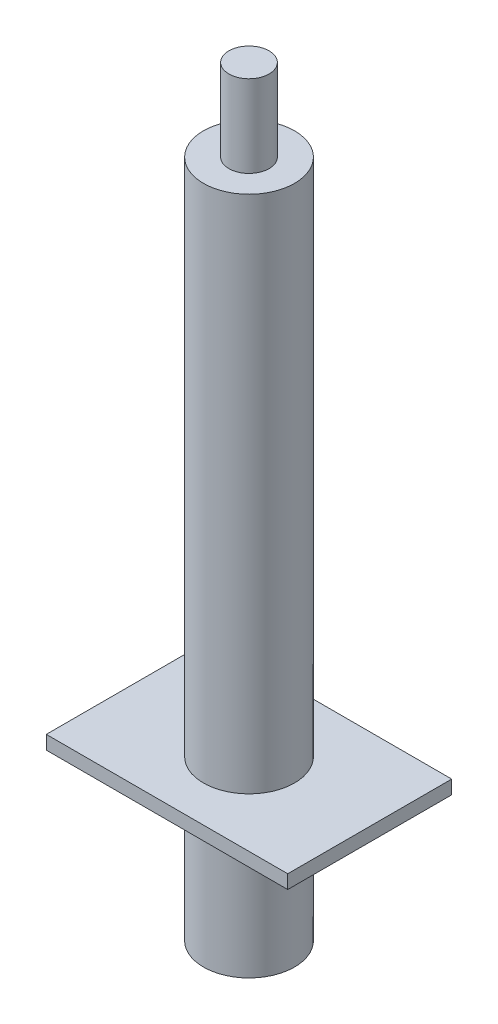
ISO-10303-21;
HEADER;
FILE_DESCRIPTION(('STEP AP214'),'2;1');
FILE_NAME('part.step','',(''),(''),'','','');
FILE_SCHEMA(('AUTOMOTIVE_DESIGN { 1 0 10303 214 1 1 1 1 }'));
ENDSEC;
DATA;
#1=APPLICATION_CONTEXT('core data for automotive mechanical design processes');
#2=APPLICATION_PROTOCOL_DEFINITION('international standard','automotive_design',2000,#1);
#3=PRODUCT_CONTEXT('',#1,'mechanical');
#4=PRODUCT('Part','Part','',(#3));
#5=PRODUCT_RELATED_PRODUCT_CATEGORY('part','',(#4));
#6=PRODUCT_DEFINITION_FORMATION('','',#4);
#7=PRODUCT_DEFINITION_CONTEXT('part definition',#1,'design');
#8=PRODUCT_DEFINITION('design','',#6,#7);
#9=PRODUCT_DEFINITION_SHAPE('','',#8);
#10=(LENGTH_UNIT() NAMED_UNIT(*) SI_UNIT(.MILLI.,.METRE.));
#11=(NAMED_UNIT(*) PLANE_ANGLE_UNIT() SI_UNIT($,.RADIAN.));
#12=(NAMED_UNIT(*) SI_UNIT($,.STERADIAN.) SOLID_ANGLE_UNIT());
#13=UNCERTAINTY_MEASURE_WITH_UNIT(LENGTH_MEASURE(1.E-05),#10,'distance_accuracy_value','');
#14=(GEOMETRIC_REPRESENTATION_CONTEXT(3) GLOBAL_UNCERTAINTY_ASSIGNED_CONTEXT((#13)) GLOBAL_UNIT_ASSIGNED_CONTEXT((#10,
#11,#12)) REPRESENTATION_CONTEXT('',''));
#15=CARTESIAN_POINT('',(0.,0.,0.));
#16=DIRECTION('',(0.,0.,1.));
#17=DIRECTION('',(1.,0.,0.));
#18=AXIS2_PLACEMENT_3D('',#15,#16,#17);
#19=CARTESIAN_POINT('',(0.,57.,0.));
#20=DIRECTION('',(0.,-1.,0.));
#21=DIRECTION('',(0.,0.,-1.));
#22=AXIS2_PLACEMENT_3D('',#19,#20,#21);
#23=CYLINDRICAL_SURFACE('',#22,5.);
#24=CARTESIAN_POINT('',(0.,57.,0.));
#25=DIRECTION('',(0.,1.,0.));
#26=DIRECTION('',(0.,0.,1.));
#27=AXIS2_PLACEMENT_3D('',#24,#25,#26);
#28=CIRCLE('',#27,5.);
#29=CARTESIAN_POINT('',(0.,57.,-5.));
#30=VERTEX_POINT('',#29);
#31=EDGE_CURVE('E123',#30,#30,#28,.T.);
#32=CARTESIAN_POINT('',(0.,0.,0.));
#33=DIRECTION('',(0.,1.,0.));
#34=DIRECTION('',(0.,0.,1.));
#35=AXIS2_PLACEMENT_3D('',#32,#33,#34);
#36=CIRCLE('',#35,5.);
#37=CARTESIAN_POINT('',(0.,0.,-5.));
#38=VERTEX_POINT('',#37);
#39=EDGE_CURVE('E44',#38,#38,#36,.T.);
#40=CARTESIAN_POINT('',(0.,57.,-5.));
#41=CARTESIAN_POINT('',(0.,56.40625,-5.));
#42=CARTESIAN_POINT('',(0.,55.8125,-5.));
#43=CARTESIAN_POINT('',(0.,54.625,-5.));
#44=CARTESIAN_POINT('',(0.,54.03125,-5.));
#45=CARTESIAN_POINT('',(0.,52.84375,-5.));
#46=CARTESIAN_POINT('',(0.,52.25,-5.));
#47=CARTESIAN_POINT('',(0.,51.0625,-5.));
#48=CARTESIAN_POINT('',(0.,50.46875,-5.));
#49=CARTESIAN_POINT('',(0.,49.28125,-5.));
#50=CARTESIAN_POINT('',(0.,48.6875,-5.));
#51=CARTESIAN_POINT('',(0.,47.5,-5.));
#52=CARTESIAN_POINT('',(0.,46.90625,-5.));
#53=CARTESIAN_POINT('',(0.,45.71875,-5.));
#54=CARTESIAN_POINT('',(0.,45.125,-5.));
#55=CARTESIAN_POINT('',(0.,43.9375,-5.));
#56=CARTESIAN_POINT('',(0.,43.34375,-5.));
#57=CARTESIAN_POINT('',(0.,42.15625,-5.));
#58=CARTESIAN_POINT('',(0.,41.5625,-5.));
#59=CARTESIAN_POINT('',(0.,40.375,-5.));
#60=CARTESIAN_POINT('',(0.,39.78125,-5.));
#61=CARTESIAN_POINT('',(0.,38.59375,-5.));
#62=CARTESIAN_POINT('',(0.,38.,-5.));
#63=CARTESIAN_POINT('',(0.,36.8125,-5.));
#64=CARTESIAN_POINT('',(0.,36.21875,-5.));
#65=CARTESIAN_POINT('',(0.,35.03125,-5.));
#66=CARTESIAN_POINT('',(0.,34.4375,-5.));
#67=CARTESIAN_POINT('',(0.,33.25,-5.));
#68=CARTESIAN_POINT('',(0.,32.65625,-5.));
#69=CARTESIAN_POINT('',(0.,31.46875,-5.));
#70=CARTESIAN_POINT('',(0.,30.875,-5.));
#71=CARTESIAN_POINT('',(0.,29.6875,-5.));
#72=CARTESIAN_POINT('',(0.,29.09375,-5.));
#73=CARTESIAN_POINT('',(0.,27.90625,-5.));
#74=CARTESIAN_POINT('',(0.,27.3125,-5.));
#75=CARTESIAN_POINT('',(0.,26.125,-5.));
#76=CARTESIAN_POINT('',(0.,25.53125,-5.));
#77=CARTESIAN_POINT('',(0.,24.34375,-5.));
#78=CARTESIAN_POINT('',(0.,23.75,-5.));
#79=CARTESIAN_POINT('',(0.,22.5625,-5.));
#80=CARTESIAN_POINT('',(0.,21.96875,-5.));
#81=CARTESIAN_POINT('',(0.,20.78125,-5.));
#82=CARTESIAN_POINT('',(0.,20.1875,-5.));
#83=CARTESIAN_POINT('',(0.,19.,-5.));
#84=CARTESIAN_POINT('',(0.,18.40625,-5.));
#85=CARTESIAN_POINT('',(0.,17.21875,-5.));
#86=CARTESIAN_POINT('',(0.,16.625,-5.));
#87=CARTESIAN_POINT('',(0.,15.4375,-5.));
#88=CARTESIAN_POINT('',(0.,14.84375,-5.));
#89=CARTESIAN_POINT('',(0.,13.65625,-5.));
#90=CARTESIAN_POINT('',(0.,13.0625,-5.));
#91=CARTESIAN_POINT('',(0.,11.875,-5.));
#92=CARTESIAN_POINT('',(0.,11.28125,-5.));
#93=CARTESIAN_POINT('',(0.,10.09375,-5.));
#94=CARTESIAN_POINT('',(0.,9.5,-5.));
#95=CARTESIAN_POINT('',(0.,8.3125,-5.));
#96=CARTESIAN_POINT('',(0.,7.71875,-5.));
#97=CARTESIAN_POINT('',(0.,6.53125,-5.));
#98=CARTESIAN_POINT('',(0.,5.9375,-5.));
#99=CARTESIAN_POINT('',(0.,4.75,-5.));
#100=CARTESIAN_POINT('',(0.,4.15625,-5.));
#101=CARTESIAN_POINT('',(0.,2.96875,-5.));
#102=CARTESIAN_POINT('',(0.,2.375,-5.));
#103=CARTESIAN_POINT('',(0.,1.1875,-5.));
#104=CARTESIAN_POINT('',(0.,0.593749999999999,-5.));
#105=CARTESIAN_POINT('',(0.,0.,-5.));
#106=B_SPLINE_CURVE_WITH_KNOTS('',3,(#40,#41,#42,#43,#44,#45,#46,#47,#48,#49,#50,#51,#52,#53,
#54,#55,#56,#57,#58,#59,#60,#61,#62,#63,#64,#65,#66,#67,#68,#69,#70,#71,#72,#73,#74,#75,#76,#77,
#78,#79,#80,#81,#82,#83,#84,#85,#86,#87,#88,#89,#90,#91,#92,#93,#94,#95,#96,#97,#98,#99,#100,
#101,#102,#103,#104,#105),.UNSPECIFIED.,.F.,.F.,(4,2,2,2,2,2,2,2,2,2,2,2,2,2,2,2,2,2,2,2,2,2,2,
2,2,2,2,2,2,2,2,2,4),(0.,1.78125,3.5625,5.34374999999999,7.12499999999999,8.90625,10.6875,
12.46875,14.25,16.03125,17.8125,19.59375,21.375,23.15625,24.9375,26.71875,28.5,30.28125,32.0625,
33.84375,35.625,37.40625,39.1875,40.96875,42.75,44.53125,46.3125,48.09375,49.875,51.65625,
53.4375,55.21875,57.),.UNSPECIFIED.);
#107=EDGE_CURVE('BSEAM41',#30,#38,#106,.T.);
#108=ORIENTED_EDGE('',*,*,#31,.F.);
#109=ORIENTED_EDGE('',*,*,#39,.T.);
#110=ORIENTED_EDGE('',*,*,#107,.T.);
#111=ORIENTED_EDGE('',*,*,#107,.F.);
#112=EDGE_LOOP('',(#108,#110,#109,#111));
#113=FACE_BOUND('',#112,.T.);
#114=ADVANCED_FACE('F41',(#113),#23,.T.);
#115=CARTESIAN_POINT('',(0.,57.,0.));
#116=DIRECTION('',(0.,1.,0.));
#117=DIRECTION('',(0.,0.,1.));
#118=AXIS2_PLACEMENT_3D('',#115,#116,#117);
#119=PLANE('',#118);
#120=CARTESIAN_POINT('',(0.,57.,0.));
#121=DIRECTION('',(0.,1.,0.));
#122=DIRECTION('',(0.,0.,1.));
#123=AXIS2_PLACEMENT_3D('',#120,#121,#122);
#124=CIRCLE('',#123,2.20376627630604);
#125=CARTESIAN_POINT('',(0.,57.,2.20376627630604));
#126=VERTEX_POINT('',#125);
#127=EDGE_CURVE('E50',#126,#126,#124,.T.);
#128=ORIENTED_EDGE('',*,*,#127,.F.);
#129=EDGE_LOOP('',(#128));
#130=FACE_BOUND('',#129,.T.);
#131=ORIENTED_EDGE('',*,*,#31,.T.);
#132=EDGE_LOOP('',(#131));
#133=FACE_BOUND('',#132,.T.);
#134=ADVANCED_FACE('F128',(#130,#133),#119,.T.);
#135=CARTESIAN_POINT('',(0.,66.,0.));
#136=DIRECTION('',(0.,-1.,0.));
#137=DIRECTION('',(0.,0.,-1.));
#138=AXIS2_PLACEMENT_3D('',#135,#136,#137);
#139=CYLINDRICAL_SURFACE('',#138,2.20376627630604);
#140=CARTESIAN_POINT('',(0.,66.,0.));
#141=DIRECTION('',(0.,1.,0.));
#142=DIRECTION('',(0.,0.,1.));
#143=AXIS2_PLACEMENT_3D('',#140,#141,#142);
#144=CIRCLE('',#143,2.20376627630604);
#145=CARTESIAN_POINT('',(0.,66.,2.20376627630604));
#146=VERTEX_POINT('',#145);
#147=EDGE_CURVE('E120',#146,#146,#144,.T.);
#148=ORIENTED_EDGE('',*,*,#147,.F.);
#149=EDGE_LOOP('',(#148));
#150=FACE_BOUND('',#149,.T.);
#151=ORIENTED_EDGE('',*,*,#127,.T.);
#152=EDGE_LOOP('',(#151));
#153=FACE_BOUND('',#152,.T.);
#154=ADVANCED_FACE('F161',(#150,#153),#139,.T.);
#155=CARTESIAN_POINT('',(0.,66.,0.));
#156=DIRECTION('',(0.,1.,0.));
#157=DIRECTION('',(0.,0.,1.));
#158=AXIS2_PLACEMENT_3D('',#155,#156,#157);
#159=PLANE('',#158);
#160=ORIENTED_EDGE('',*,*,#147,.T.);
#161=EDGE_LOOP('',(#160));
#162=FACE_BOUND('',#161,.T.);
#163=ADVANCED_FACE('F158',(#162),#159,.T.);
#164=CARTESIAN_POINT('',(13.25,-1.5,-9.));
#165=DIRECTION('',(-1.,0.,0.));
#166=DIRECTION('',(0.,0.,1.));
#167=AXIS2_PLACEMENT_3D('',#164,#165,#166);
#168=PLANE('',#167);
#169=DIRECTION('',(0.,0.,1.));
#170=VECTOR('',#169,1.);
#171=CARTESIAN_POINT('',(13.25,0.,-9.));
#172=LINE('',#171,#170);
#173=CARTESIAN_POINT('',(13.25,0.,-9.));
#174=VERTEX_POINT('',#173);
#175=CARTESIAN_POINT('',(13.25,0.,9.));
#176=VERTEX_POINT('',#175);
#177=EDGE_CURVE('E110',#174,#176,#172,.T.);
#178=ORIENTED_EDGE('',*,*,#177,.T.);
#179=DIRECTION('',(0.,1.,0.));
#180=VECTOR('',#179,1.);
#181=CARTESIAN_POINT('',(13.25,-1.5,9.));
#182=LINE('',#181,#180);
#183=CARTESIAN_POINT('',(13.25,-1.5,9.));
#184=VERTEX_POINT('',#183);
#185=EDGE_CURVE('E101',#184,#176,#182,.T.);
#186=ORIENTED_EDGE('',*,*,#185,.F.);
#187=DIRECTION('',(0.,0.,1.));
#188=VECTOR('',#187,1.);
#189=CARTESIAN_POINT('',(13.25,-1.5,-9.));
#190=LINE('',#189,#188);
#191=CARTESIAN_POINT('',(13.25,-1.5,-9.));
#192=VERTEX_POINT('',#191);
#193=EDGE_CURVE('E95',#192,#184,#190,.T.);
#194=ORIENTED_EDGE('',*,*,#193,.F.);
#195=DIRECTION('',(0.,1.,0.));
#196=VECTOR('',#195,1.);
#197=CARTESIAN_POINT('',(13.25,-1.5,-9.));
#198=LINE('',#197,#196);
#199=EDGE_CURVE('E106',#192,#174,#198,.T.);
#200=ORIENTED_EDGE('',*,*,#199,.T.);
#201=EDGE_LOOP('',(#178,#186,#194,#200));
#202=FACE_BOUND('',#201,.T.);
#203=ADVANCED_FACE('F142',(#202),#168,.F.);
#204=CARTESIAN_POINT('',(-13.25,-1.5,9.));
#205=DIRECTION('',(0.,0.,-1.));
#206=DIRECTION('',(-1.,0.,0.));
#207=AXIS2_PLACEMENT_3D('',#204,#205,#206);
#208=PLANE('',#207);
#209=DIRECTION('',(-1.,0.,0.));
#210=VECTOR('',#209,1.);
#211=CARTESIAN_POINT('',(-13.25,0.,9.));
#212=LINE('',#211,#210);
#213=CARTESIAN_POINT('',(-13.25,0.,9.));
#214=VERTEX_POINT('',#213);
#215=EDGE_CURVE('E100',#176,#214,#212,.T.);
#216=ORIENTED_EDGE('',*,*,#215,.T.);
#217=DIRECTION('',(0.,1.,0.));
#218=VECTOR('',#217,1.);
#219=CARTESIAN_POINT('',(-13.25,-1.5,9.));
#220=LINE('',#219,#218);
#221=CARTESIAN_POINT('',(-13.25,-1.5,9.));
#222=VERTEX_POINT('',#221);
#223=EDGE_CURVE('E98',#222,#214,#220,.T.);
#224=ORIENTED_EDGE('',*,*,#223,.F.);
#225=DIRECTION('',(-1.,0.,0.));
#226=VECTOR('',#225,1.);
#227=CARTESIAN_POINT('',(-13.25,-1.5,9.));
#228=LINE('',#227,#226);
#229=EDGE_CURVE('E90',#184,#222,#228,.T.);
#230=ORIENTED_EDGE('',*,*,#229,.F.);
#231=ORIENTED_EDGE('',*,*,#185,.T.);
#232=EDGE_LOOP('',(#216,#224,#230,#231));
#233=FACE_BOUND('',#232,.T.);
#234=ADVANCED_FACE('F99',(#233),#208,.F.);
#235=CARTESIAN_POINT('',(-13.25,-1.5,-9.));
#236=DIRECTION('',(1.,0.,0.));
#237=DIRECTION('',(0.,0.,-1.));
#238=AXIS2_PLACEMENT_3D('',#235,#236,#237);
#239=PLANE('',#238);
#240=DIRECTION('',(0.,0.,-1.));
#241=VECTOR('',#240,1.);
#242=CARTESIAN_POINT('',(-13.25,0.,-9.));
#243=LINE('',#242,#241);
#244=CARTESIAN_POINT('',(-13.25,0.,-9.));
#245=VERTEX_POINT('',#244);
#246=EDGE_CURVE('E76',#214,#245,#243,.T.);
#247=ORIENTED_EDGE('',*,*,#246,.T.);
#248=DIRECTION('',(0.,1.,0.));
#249=VECTOR('',#248,1.);
#250=CARTESIAN_POINT('',(-13.25,-1.5,-9.));
#251=LINE('',#250,#249);
#252=CARTESIAN_POINT('',(-13.25,-1.5,-9.));
#253=VERTEX_POINT('',#252);
#254=EDGE_CURVE('E102',#253,#245,#251,.T.);
#255=ORIENTED_EDGE('',*,*,#254,.F.);
#256=DIRECTION('',(0.,0.,-1.));
#257=VECTOR('',#256,1.);
#258=CARTESIAN_POINT('',(-13.25,-1.5,-9.));
#259=LINE('',#258,#257);
#260=EDGE_CURVE('E93',#222,#253,#259,.T.);
#261=ORIENTED_EDGE('',*,*,#260,.F.);
#262=ORIENTED_EDGE('',*,*,#223,.T.);
#263=EDGE_LOOP('',(#247,#255,#261,#262));
#264=FACE_BOUND('',#263,.T.);
#265=ADVANCED_FACE('F104',(#264),#239,.F.);
#266=CARTESIAN_POINT('',(-13.25,-1.5,-9.));
#267=DIRECTION('',(0.,0.,1.));
#268=DIRECTION('',(1.,0.,0.));
#269=AXIS2_PLACEMENT_3D('',#266,#267,#268);
#270=PLANE('',#269);
#271=DIRECTION('',(1.,0.,0.));
#272=VECTOR('',#271,1.);
#273=CARTESIAN_POINT('',(-13.25,0.,-9.));
#274=LINE('',#273,#272);
#275=EDGE_CURVE('E82',#245,#174,#274,.T.);
#276=ORIENTED_EDGE('',*,*,#275,.T.);
#277=ORIENTED_EDGE('',*,*,#199,.F.);
#278=DIRECTION('',(1.,0.,0.));
#279=VECTOR('',#278,1.);
#280=CARTESIAN_POINT('',(-13.25,-1.5,-9.));
#281=LINE('',#280,#279);
#282=EDGE_CURVE('E59',#253,#192,#281,.T.);
#283=ORIENTED_EDGE('',*,*,#282,.F.);
#284=ORIENTED_EDGE('',*,*,#254,.T.);
#285=EDGE_LOOP('',(#276,#277,#283,#284));
#286=FACE_BOUND('',#285,.T.);
#287=ADVANCED_FACE('F143',(#286),#270,.F.);
#288=CARTESIAN_POINT('',(0.,-1.5,0.));
#289=DIRECTION('',(0.,1.,0.));
#290=DIRECTION('',(0.,0.,1.));
#291=AXIS2_PLACEMENT_3D('',#288,#289,#290);
#292=PLANE('',#291);
#293=CARTESIAN_POINT('',(0.,-1.5,0.));
#294=DIRECTION('',(0.,-1.,0.));
#295=DIRECTION('',(0.,0.,-1.));
#296=AXIS2_PLACEMENT_3D('',#293,#294,#295);
#297=CIRCLE('',#296,5.);
#298=CARTESIAN_POINT('',(0.,-1.5,-5.));
#299=VERTEX_POINT('',#298);
#300=EDGE_CURVE('E11',#299,#299,#297,.T.);
#301=ORIENTED_EDGE('',*,*,#300,.F.);
#302=EDGE_LOOP('',(#301));
#303=FACE_BOUND('',#302,.T.);
#304=ORIENTED_EDGE('',*,*,#193,.T.);
#305=ORIENTED_EDGE('',*,*,#229,.T.);
#306=ORIENTED_EDGE('',*,*,#260,.T.);
#307=ORIENTED_EDGE('',*,*,#282,.T.);
#308=EDGE_LOOP('',(#304,#305,#306,#307));
#309=FACE_BOUND('',#308,.T.);
#310=ADVANCED_FACE('F91',(#303,#309),#292,.F.);
#311=CARTESIAN_POINT('',(0.,0.,0.));
#312=DIRECTION('',(0.,1.,0.));
#313=DIRECTION('',(0.,0.,1.));
#314=AXIS2_PLACEMENT_3D('',#311,#312,#313);
#315=PLANE('',#314);
#316=ORIENTED_EDGE('',*,*,#39,.F.);
#317=EDGE_LOOP('',(#316));
#318=FACE_BOUND('',#317,.T.);
#319=ORIENTED_EDGE('',*,*,#177,.F.);
#320=ORIENTED_EDGE('',*,*,#275,.F.);
#321=ORIENTED_EDGE('',*,*,#246,.F.);
#322=ORIENTED_EDGE('',*,*,#215,.F.);
#323=EDGE_LOOP('',(#319,#320,#321,#322));
#324=FACE_BOUND('',#323,.T.);
#325=ADVANCED_FACE('F135',(#318,#324),#315,.T.);
#326=CARTESIAN_POINT('',(0.,-17.5,0.));
#327=DIRECTION('',(0.,1.,0.));
#328=DIRECTION('',(0.,0.,1.));
#329=AXIS2_PLACEMENT_3D('',#326,#327,#328);
#330=CYLINDRICAL_SURFACE('',#329,5.);
#331=CARTESIAN_POINT('',(0.,-17.5,0.));
#332=DIRECTION('',(0.,-1.,0.));
#333=DIRECTION('',(0.,0.,-1.));
#334=AXIS2_PLACEMENT_3D('',#331,#332,#333);
#335=CIRCLE('',#334,5.);
#336=CARTESIAN_POINT('',(0.,-17.5,-5.));
#337=VERTEX_POINT('',#336);
#338=EDGE_CURVE('E113',#337,#337,#335,.T.);
#339=ORIENTED_EDGE('',*,*,#338,.F.);
#340=EDGE_LOOP('',(#339));
#341=FACE_BOUND('',#340,.T.);
#342=ORIENTED_EDGE('',*,*,#300,.T.);
#343=EDGE_LOOP('',(#342));
#344=FACE_BOUND('',#343,.T.);
#345=ADVANCED_FACE('F138',(#341,#344),#330,.T.);
#346=CARTESIAN_POINT('',(0.,-17.5,0.));
#347=DIRECTION('',(0.,-1.,0.));
#348=DIRECTION('',(0.,0.,-1.));
#349=AXIS2_PLACEMENT_3D('',#346,#347,#348);
#350=PLANE('',#349);
#351=ORIENTED_EDGE('',*,*,#338,.T.);
#352=EDGE_LOOP('',(#351));
#353=FACE_BOUND('',#352,.T.);
#354=ADVANCED_FACE('F224',(#353),#350,.T.);
#355=CLOSED_SHELL('',(#114,#134,#154,#163,#203,#234,#265,#287,#310,#325,#345,#354));
#356=MANIFOLD_SOLID_BREP('B2',#355);
#357=ADVANCED_BREP_SHAPE_REPRESENTATION('',(#18,#356),#14);
#358=SHAPE_DEFINITION_REPRESENTATION(#9,#357);
ENDSEC;
END-ISO-10303-21;
